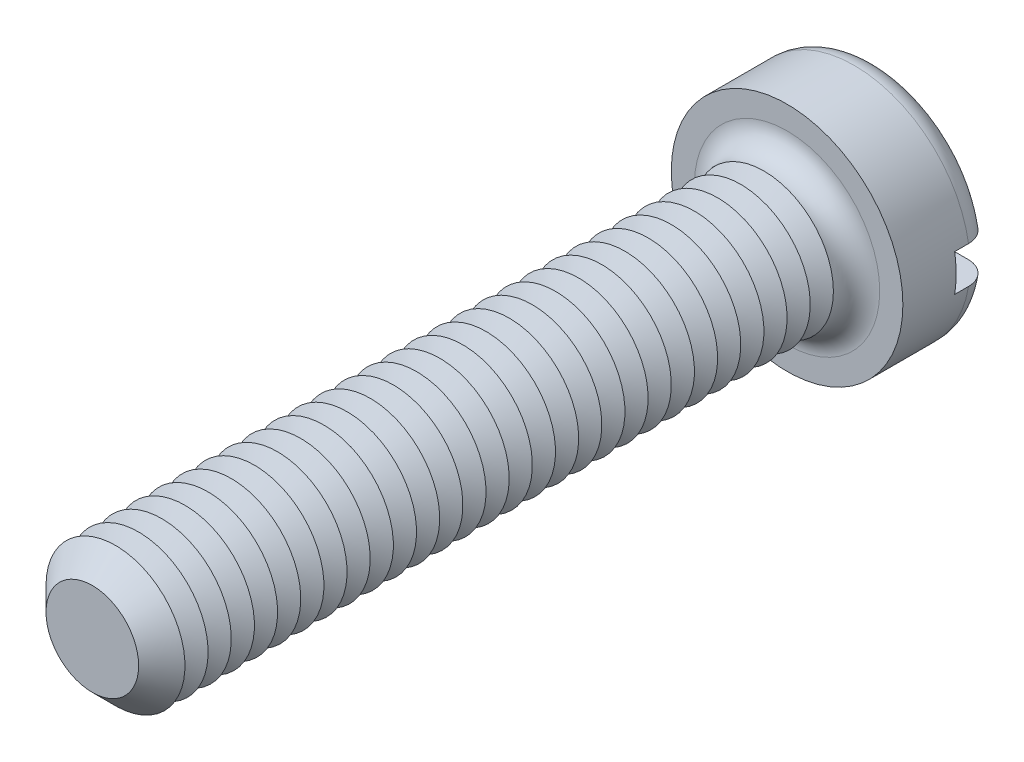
from build123d import *

# Parameters (mm, degrees)
SKETCH3_R           = 5
BOSS_EXTRUDE2_DEPTH = 3.9
SKETCH4_R           = 3
BOSS_EXTRUDE3_DEPTH = 30
FILLET1_R           = 1
CHAMFER1_SIZE       = 1
LPATTERN1_COUNT     = 28
LPATTERN1_PITCH     = 1
SKETCH8_W           = 10
SKETCH8_H           = 1.6
CUT_EXTRUDE1_DEPTH  = 1.6


with BuildPart() as part:
    # Sketch3 → Boss-Extrude2 (new body)
    with BuildSketch(Plane.XY):
        Circle(SKETCH3_R)
    extrude(amount=-BOSS_EXTRUDE2_DEPTH)

    # Sketch4 → Boss-Extrude3 (add)
    with BuildSketch(Plane.XY):
        Circle(SKETCH4_R)
    extrude(amount=BOSS_EXTRUDE3_DEPTH)

    # Fillet1
    fillet1_edges = [part.edges().sort_by_distance(p)[0] for p in [
        (-5, 0, -3.9),
        (-3, 0, 0),
    ]]
    fillet(fillet1_edges, radius=FILLET1_R)

    # Chamfer1
    chamfer1_edges = [part.edges().sort_by_distance(p)[0] for p in [
        (-3, 0, 30),
    ]]
    chamfer(chamfer1_edges, length=CHAMFER1_SIZE)

    # Sketch6 → Cut-Revolve1 (revolve, cut)
    with BuildSketch(Plane(origin=(0, 0, 0), x_dir=(0, 0, -1), z_dir=(1, 0, 0)), mode=Mode.PRIVATE) as cut_revolve1_sk:
        Polygon((-1, 3), (-1.5, 2.133974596), (-2, 3), align=None)
    cut_revolve1 = revolve(cut_revolve1_sk.sketch.rotate(Axis((0, 0, -1.694361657), (0, 0, 1)), 90), axis=Axis((0, 0, -1.694361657), (0, 0, 1)), mode=Mode.SUBTRACT)

    # LPattern1: Cut-Revolve1 ×28
    with Locations(*[(0, 0, i * LPATTERN1_PITCH) for i in range(1, LPATTERN1_COUNT)]):
        add(cut_revolve1, mode=Mode.SUBTRACT)

    # Sketch8 → Cut-Extrude1 (cut)
    with BuildSketch(Plane(origin=(0, 0, -3.9), x_dir=(-1, 0, 0), z_dir=(0, 0, -1))):
        Rectangle(SKETCH8_W, SKETCH8_H)
    extrude(amount=-CUT_EXTRUDE1_DEPTH, mode=Mode.SUBTRACT)


solid = part.part
